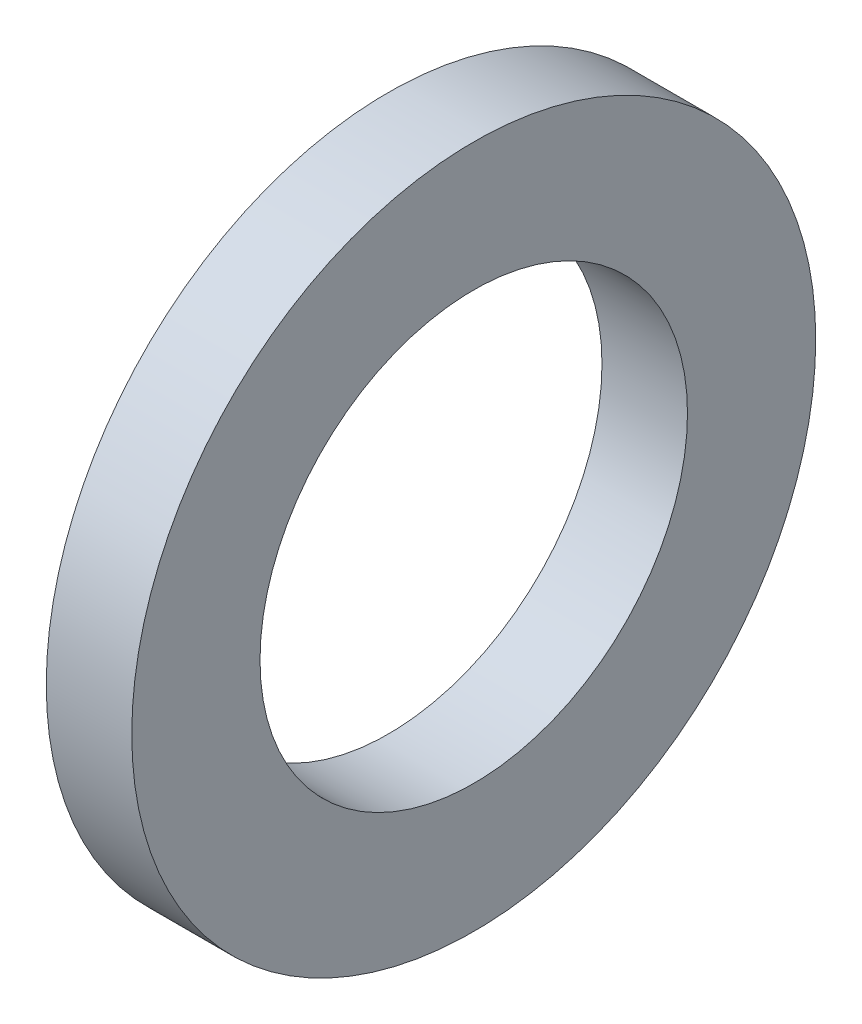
from build123d import *

# Parameters (mm, degrees)
SKETCH1_W = 3.175
SKETCH1_H = 4.7625


with BuildPart() as part:
    # Sketch1 → Revolve1 (revolve)
    with BuildSketch(Plane(origin=(0, 0, 0), x_dir=(1, 0, 0), z_dir=(0, 1, 0))):
        with Locations((-1.5875, 10.31875)):
            Rectangle(SKETCH1_W, SKETCH1_H)
    revolve(axis=Axis((0, 0, 0), (-1, 0, 0)))


solid = part.part
